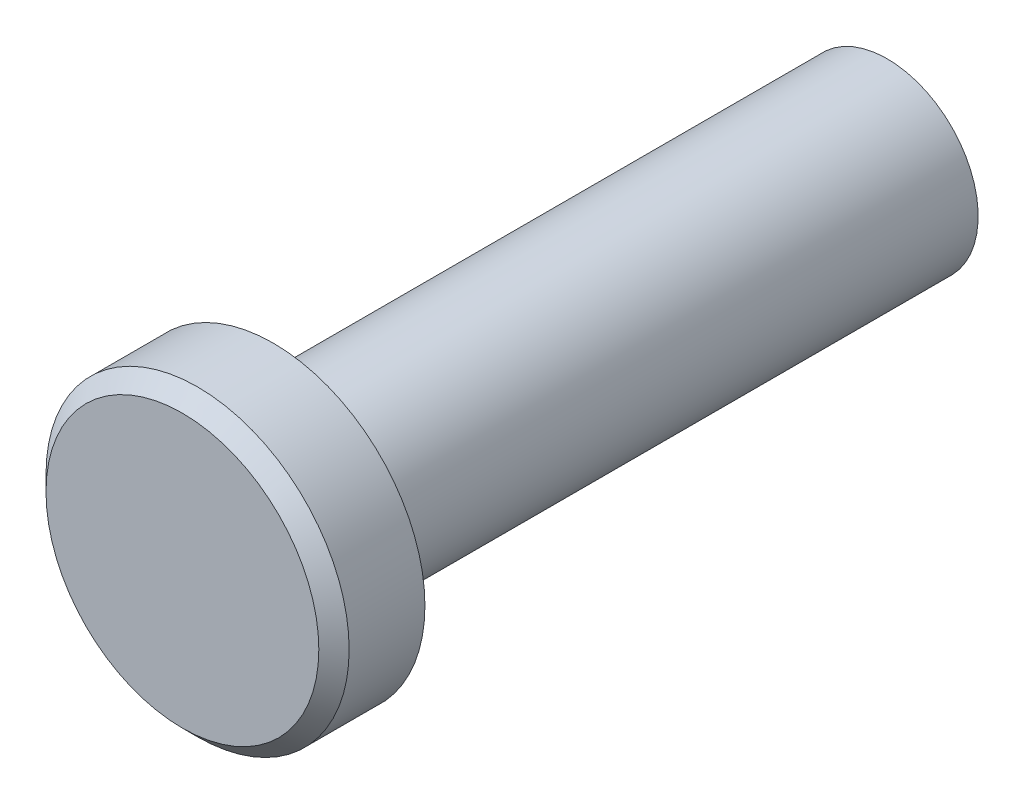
from build123d import *

# Parameters (mm, degrees)
SKETCH1_R           = 5
BOSS_EXTRUDE1_DEPTH = 3
SKETCH2_R           = 3
BOSS_EXTRUDE2_DEPTH = 20.25
CHAMFER1_SIZE       = 0.5


with BuildPart() as part:
    # Sketch1 → Boss-Extrude1 (new body)
    with BuildSketch(Plane.XY):
        Circle(SKETCH1_R)
    extrude(amount=BOSS_EXTRUDE1_DEPTH)

    # Sketch2 → Boss-Extrude2 (add)
    with BuildSketch(Plane(origin=(0, 0, 0), x_dir=(-1, 0, 0), z_dir=(0, 0, -1))):
        Circle(SKETCH2_R)
    extrude(amount=BOSS_EXTRUDE2_DEPTH)

    # Chamfer1
    chamfer1_edges = [part.edges().sort_by_distance(p)[0] for p in [
        (-5, 0, 3),
    ]]
    chamfer(chamfer1_edges, length=CHAMFER1_SIZE)


solid = part.part
